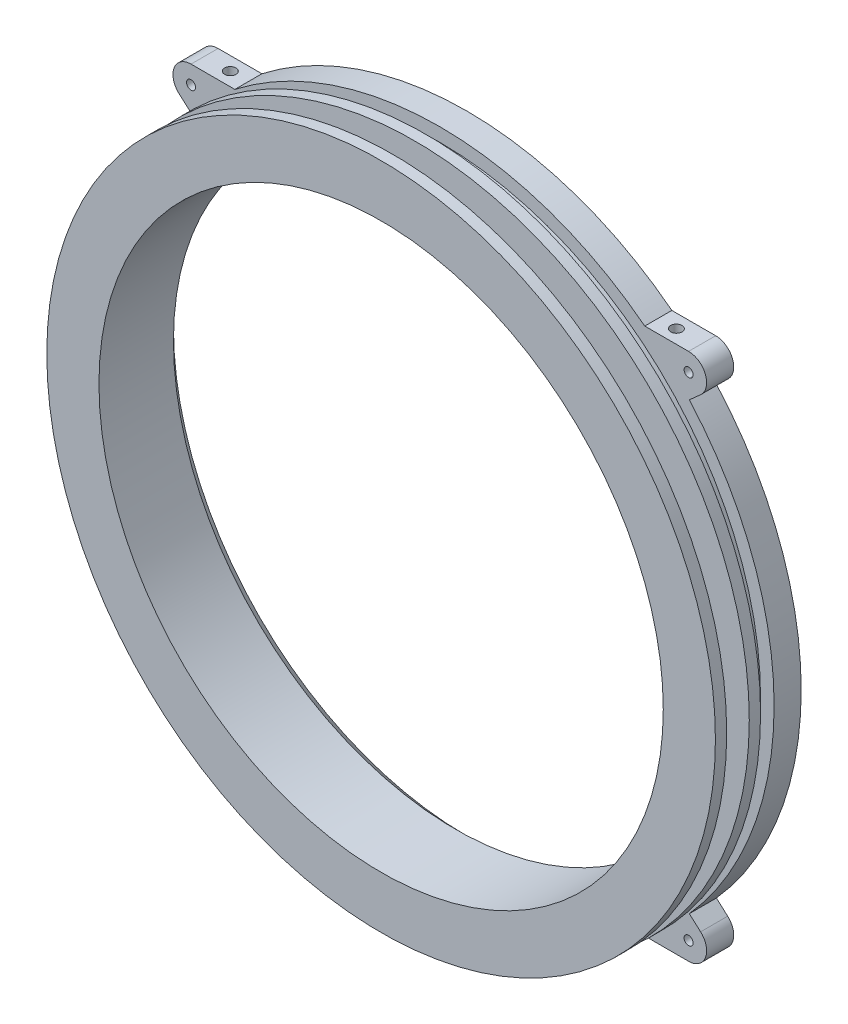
ISO-10303-21;
HEADER;
FILE_DESCRIPTION(('STEP AP214'),'2;1');
FILE_NAME('part.step','',(''),(''),'','','');
FILE_SCHEMA(('AUTOMOTIVE_DESIGN { 1 0 10303 214 1 1 1 1 }'));
ENDSEC;
DATA;
#1=APPLICATION_CONTEXT('core data for automotive mechanical design processes');
#2=APPLICATION_PROTOCOL_DEFINITION('international standard','automotive_design',2000,#1);
#3=PRODUCT_CONTEXT('',#1,'mechanical');
#4=PRODUCT('Part','Part','',(#3));
#5=PRODUCT_RELATED_PRODUCT_CATEGORY('part','',(#4));
#6=PRODUCT_DEFINITION_FORMATION('','',#4);
#7=PRODUCT_DEFINITION_CONTEXT('part definition',#1,'design');
#8=PRODUCT_DEFINITION('design','',#6,#7);
#9=PRODUCT_DEFINITION_SHAPE('','',#8);
#10=(LENGTH_UNIT() NAMED_UNIT(*) SI_UNIT(.MILLI.,.METRE.));
#11=(NAMED_UNIT(*) PLANE_ANGLE_UNIT() SI_UNIT($,.RADIAN.));
#12=(NAMED_UNIT(*) SI_UNIT($,.STERADIAN.) SOLID_ANGLE_UNIT());
#13=UNCERTAINTY_MEASURE_WITH_UNIT(LENGTH_MEASURE(1.E-05),#10,'distance_accuracy_value','');
#14=(GEOMETRIC_REPRESENTATION_CONTEXT(3) GLOBAL_UNCERTAINTY_ASSIGNED_CONTEXT((#13)) GLOBAL_UNIT_ASSIGNED_CONTEXT((#10,
#11,#12)) REPRESENTATION_CONTEXT('',''));
#15=CARTESIAN_POINT('',(0.,0.,0.));
#16=DIRECTION('',(0.,0.,1.));
#17=DIRECTION('',(1.,0.,0.));
#18=AXIS2_PLACEMENT_3D('',#15,#16,#17);
#19=CARTESIAN_POINT('',(0.,0.,12.));
#20=DIRECTION('',(0.,0.,-1.));
#21=DIRECTION('',(-1.,0.,0.));
#22=AXIS2_PLACEMENT_3D('',#19,#20,#21);
#23=CYLINDRICAL_SURFACE('',#22,148.1);
#24=DIRECTION('',(0.,0.,-1.));
#25=VECTOR('',#24,1.);
#26=CARTESIAN_POINT('',(-110.532726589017,-98.5704131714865,12.));
#27=LINE('',#26,#25);
#28=CARTESIAN_POINT('',(-110.532726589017,-98.5704131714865,12.));
#29=VERTEX_POINT('',#28);
#30=CARTESIAN_POINT('',(-110.532726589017,-98.5704131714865,0.));
#31=VERTEX_POINT('',#30);
#32=EDGE_CURVE('E63',#29,#31,#27,.T.);
#33=ORIENTED_EDGE('',*,*,#32,.F.);
#34=CARTESIAN_POINT('',(0.,0.,12.));
#35=DIRECTION('',(0.,0.,1.));
#36=DIRECTION('',(1.,0.,0.));
#37=AXIS2_PLACEMENT_3D('',#34,#35,#36);
#38=CIRCLE('',#37,148.1);
#39=CARTESIAN_POINT('',(-110.532726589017,98.5704131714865,12.));
#40=VERTEX_POINT('',#39);
#41=EDGE_CURVE('E161',#40,#29,#38,.T.);
#42=ORIENTED_EDGE('',*,*,#41,.F.);
#43=DIRECTION('',(0.,0.,-1.));
#44=VECTOR('',#43,1.);
#45=CARTESIAN_POINT('',(-110.532726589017,98.5704131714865,12.));
#46=LINE('',#45,#44);
#47=CARTESIAN_POINT('',(-110.532726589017,98.5704131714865,0.));
#48=VERTEX_POINT('',#47);
#49=EDGE_CURVE('E272',#40,#48,#46,.T.);
#50=ORIENTED_EDGE('',*,*,#49,.T.);
#51=CARTESIAN_POINT('',(0.,0.,0.));
#52=DIRECTION('',(0.,0.,1.));
#53=DIRECTION('',(1.,0.,0.));
#54=AXIS2_PLACEMENT_3D('',#51,#52,#53);
#55=CIRCLE('',#54,148.1);
#56=EDGE_CURVE('E318',#48,#31,#55,.T.);
#57=ORIENTED_EDGE('',*,*,#56,.T.);
#58=EDGE_LOOP('',(#33,#42,#50,#57));
#59=FACE_BOUND('',#58,.T.);
#60=ADVANCED_FACE('F40',(#59),#23,.T.);
#61=DIRECTION('',(0.,0.,-1.));
#62=VECTOR('',#61,1.);
#63=CARTESIAN_POINT('',(-90.7998348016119,-117.,12.));
#64=LINE('',#63,#62);
#65=CARTESIAN_POINT('',(-90.7998348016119,-117.,12.));
#66=VERTEX_POINT('',#65);
#67=CARTESIAN_POINT('',(-90.7998348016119,-117.,0.));
#68=VERTEX_POINT('',#67);
#69=EDGE_CURVE('E179',#66,#68,#64,.T.);
#70=ORIENTED_EDGE('',*,*,#69,.T.);
#71=CARTESIAN_POINT('',(90.7998348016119,-117.,0.));
#72=VERTEX_POINT('',#71);
#73=EDGE_CURVE('E319',#68,#72,#55,.T.);
#74=ORIENTED_EDGE('',*,*,#73,.T.);
#75=DIRECTION('',(0.,0.,-1.));
#76=VECTOR('',#75,1.);
#77=CARTESIAN_POINT('',(90.799834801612,-117.,12.));
#78=LINE('',#77,#76);
#79=CARTESIAN_POINT('',(90.7998348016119,-117.,12.));
#80=VERTEX_POINT('',#79);
#81=EDGE_CURVE('E217',#80,#72,#78,.T.);
#82=ORIENTED_EDGE('',*,*,#81,.F.);
#83=EDGE_CURVE('E55',#66,#80,#38,.T.);
#84=ORIENTED_EDGE('',*,*,#83,.F.);
#85=EDGE_LOOP('',(#70,#74,#82,#84));
#86=FACE_BOUND('',#85,.T.);
#87=ADVANCED_FACE('F337',(#86),#23,.T.);
#88=DIRECTION('',(0.,0.,-1.));
#89=VECTOR('',#88,1.);
#90=CARTESIAN_POINT('',(110.532726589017,-98.5704131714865,12.));
#91=LINE('',#90,#89);
#92=CARTESIAN_POINT('',(110.532726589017,-98.5704131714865,12.));
#93=VERTEX_POINT('',#92);
#94=CARTESIAN_POINT('',(110.532726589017,-98.5704131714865,0.));
#95=VERTEX_POINT('',#94);
#96=EDGE_CURVE('E220',#93,#95,#91,.T.);
#97=ORIENTED_EDGE('',*,*,#96,.T.);
#98=CARTESIAN_POINT('',(110.532726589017,98.5704131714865,0.));
#99=VERTEX_POINT('',#98);
#100=EDGE_CURVE('E354',#95,#99,#55,.T.);
#101=ORIENTED_EDGE('',*,*,#100,.T.);
#102=DIRECTION('',(0.,0.,-1.));
#103=VECTOR('',#102,1.);
#104=CARTESIAN_POINT('',(110.532726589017,98.5704131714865,12.));
#105=LINE('',#104,#103);
#106=CARTESIAN_POINT('',(110.532726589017,98.5704131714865,12.));
#107=VERTEX_POINT('',#106);
#108=EDGE_CURVE('E255',#107,#99,#105,.T.);
#109=ORIENTED_EDGE('',*,*,#108,.F.);
#110=EDGE_CURVE('E356',#93,#107,#38,.T.);
#111=ORIENTED_EDGE('',*,*,#110,.F.);
#112=EDGE_LOOP('',(#97,#101,#109,#111));
#113=FACE_BOUND('',#112,.T.);
#114=ADVANCED_FACE('F338',(#113),#23,.T.);
#115=DIRECTION('',(0.,0.,-1.));
#116=VECTOR('',#115,1.);
#117=CARTESIAN_POINT('',(90.7998348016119,117.,12.));
#118=LINE('',#117,#116);
#119=CARTESIAN_POINT('',(90.7998348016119,117.,12.));
#120=VERTEX_POINT('',#119);
#121=CARTESIAN_POINT('',(90.7998348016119,117.,0.));
#122=VERTEX_POINT('',#121);
#123=EDGE_CURVE('E241',#120,#122,#118,.T.);
#124=ORIENTED_EDGE('',*,*,#123,.T.);
#125=CARTESIAN_POINT('',(-90.7998348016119,117.,0.));
#126=VERTEX_POINT('',#125);
#127=EDGE_CURVE('E312',#122,#126,#55,.T.);
#128=ORIENTED_EDGE('',*,*,#127,.T.);
#129=DIRECTION('',(0.,0.,-1.));
#130=VECTOR('',#129,1.);
#131=CARTESIAN_POINT('',(-90.7998348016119,117.,12.));
#132=LINE('',#131,#130);
#133=CARTESIAN_POINT('',(-90.7998348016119,117.,12.));
#134=VERTEX_POINT('',#133);
#135=EDGE_CURVE('E285',#134,#126,#132,.T.);
#136=ORIENTED_EDGE('',*,*,#135,.F.);
#137=EDGE_CURVE('E317',#120,#134,#38,.T.);
#138=ORIENTED_EDGE('',*,*,#137,.F.);
#139=EDGE_LOOP('',(#124,#128,#136,#138));
#140=FACE_BOUND('',#139,.T.);
#141=ADVANCED_FACE('F343',(#140),#23,.T.);
#142=CARTESIAN_POINT('',(0.,0.,23.));
#143=DIRECTION('',(0.,0.,1.));
#144=DIRECTION('',(1.,0.,0.));
#145=AXIS2_PLACEMENT_3D('',#142,#143,#144);
#146=PLANE('',#145);
#147=CARTESIAN_POINT('',(0.,0.,23.));
#148=DIRECTION('',(0.,0.,1.));
#149=DIRECTION('',(1.,0.,0.));
#150=AXIS2_PLACEMENT_3D('',#147,#148,#149);
#151=CIRCLE('',#150,148.1);
#152=CARTESIAN_POINT('',(148.1,0.,23.));
#153=VERTEX_POINT('',#152);
#154=EDGE_CURVE('E304',#153,#153,#151,.T.);
#155=ORIENTED_EDGE('',*,*,#154,.T.);
#156=EDGE_LOOP('',(#155));
#157=FACE_BOUND('',#156,.T.);
#158=CARTESIAN_POINT('',(0.,0.,23.));
#159=DIRECTION('',(0.,0.,1.));
#160=DIRECTION('',(1.,0.,0.));
#161=AXIS2_PLACEMENT_3D('',#158,#159,#160);
#162=CIRCLE('',#161,133.1);
#163=CARTESIAN_POINT('',(133.1,0.,23.));
#164=VERTEX_POINT('',#163);
#165=EDGE_CURVE('E295',#164,#164,#162,.T.);
#166=ORIENTED_EDGE('',*,*,#165,.F.);
#167=EDGE_LOOP('',(#166));
#168=FACE_BOUND('',#167,.T.);
#169=ADVANCED_FACE('F350',(#157,#168),#146,.T.);
#170=CARTESIAN_POINT('',(0.,0.,12.));
#171=DIRECTION('',(0.,0.,1.));
#172=DIRECTION('',(1.,0.,0.));
#173=AXIS2_PLACEMENT_3D('',#170,#171,#172);
#174=PLANE('',#173);
#175=CARTESIAN_POINT('',(0.,0.,12.));
#176=DIRECTION('',(0.,0.,1.));
#177=DIRECTION('',(1.,0.,0.));
#178=AXIS2_PLACEMENT_3D('',#175,#176,#177);
#179=CIRCLE('',#178,142.1);
#180=CARTESIAN_POINT('',(142.1,0.,12.));
#181=VERTEX_POINT('',#180);
#182=EDGE_CURVE('E313',#181,#181,#179,.T.);
#183=ORIENTED_EDGE('',*,*,#182,.F.);
#184=EDGE_LOOP('',(#183));
#185=FACE_BOUND('',#184,.T.);
#186=ORIENTED_EDGE('',*,*,#41,.T.);
#187=DIRECTION('',(-0.746338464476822,-0.6655665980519,0.));
#188=VECTOR('',#187,1.);
#189=CARTESIAN_POINT('',(-115.532726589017,-103.029292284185,12.));
#190=LINE('',#189,#188);
#191=CARTESIAN_POINT('',(-115.532726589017,-103.029292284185,12.));
#192=VERTEX_POINT('',#191);
#193=EDGE_CURVE('E153',#29,#192,#190,.T.);
#194=ORIENTED_EDGE('',*,*,#193,.T.);
#195=CARTESIAN_POINT('',(-110.208193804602,-109.,12.));
#196=DIRECTION('',(0.,0.,1.));
#197=DIRECTION('',(-1.,0.,0.));
#198=AXIS2_PLACEMENT_3D('',#195,#196,#197);
#199=CIRCLE('',#198,7.99999999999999);
#200=CARTESIAN_POINT('',(-110.208193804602,-117.,12.));
#201=VERTEX_POINT('',#200);
#202=EDGE_CURVE('E158',#192,#201,#199,.T.);
#203=ORIENTED_EDGE('',*,*,#202,.T.);
#204=DIRECTION('',(1.,0.,0.));
#205=VECTOR('',#204,1.);
#206=CARTESIAN_POINT('',(-90.7998348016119,-117.,12.));
#207=LINE('',#206,#205);
#208=EDGE_CURVE('E177',#201,#66,#207,.T.);
#209=ORIENTED_EDGE('',*,*,#208,.T.);
#210=ORIENTED_EDGE('',*,*,#83,.T.);
#211=DIRECTION('',(1.,0.,0.));
#212=VECTOR('',#211,1.);
#213=CARTESIAN_POINT('',(90.7998348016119,-117.,12.));
#214=LINE('',#213,#212);
#215=CARTESIAN_POINT('',(110.208193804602,-117.,12.));
#216=VERTEX_POINT('',#215);
#217=EDGE_CURVE('E206',#80,#216,#214,.T.);
#218=ORIENTED_EDGE('',*,*,#217,.T.);
#219=CARTESIAN_POINT('',(110.208193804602,-109.,12.));
#220=DIRECTION('',(0.,0.,1.));
#221=DIRECTION('',(1.,0.,0.));
#222=AXIS2_PLACEMENT_3D('',#219,#220,#221);
#223=CIRCLE('',#222,7.99999999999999);
#224=CARTESIAN_POINT('',(115.532726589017,-103.029292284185,12.));
#225=VERTEX_POINT('',#224);
#226=EDGE_CURVE('E199',#216,#225,#223,.T.);
#227=ORIENTED_EDGE('',*,*,#226,.T.);
#228=DIRECTION('',(-0.746338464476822,0.6655665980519,0.));
#229=VECTOR('',#228,1.);
#230=CARTESIAN_POINT('',(115.532726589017,-103.029292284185,12.));
#231=LINE('',#230,#229);
#232=EDGE_CURVE('E202',#225,#93,#231,.T.);
#233=ORIENTED_EDGE('',*,*,#232,.T.);
#234=ORIENTED_EDGE('',*,*,#110,.T.);
#235=DIRECTION('',(0.746338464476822,0.6655665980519,0.));
#236=VECTOR('',#235,1.);
#237=CARTESIAN_POINT('',(115.532726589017,103.029292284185,12.));
#238=LINE('',#237,#236);
#239=CARTESIAN_POINT('',(115.532726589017,103.029292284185,12.));
#240=VERTEX_POINT('',#239);
#241=EDGE_CURVE('E233',#107,#240,#238,.T.);
#242=ORIENTED_EDGE('',*,*,#241,.T.);
#243=CARTESIAN_POINT('',(110.208193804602,109.,12.));
#244=DIRECTION('',(0.,0.,1.));
#245=DIRECTION('',(-1.,0.,0.));
#246=AXIS2_PLACEMENT_3D('',#243,#244,#245);
#247=CIRCLE('',#246,7.99999999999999);
#248=CARTESIAN_POINT('',(110.208193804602,117.,12.));
#249=VERTEX_POINT('',#248);
#250=EDGE_CURVE('E235',#240,#249,#247,.T.);
#251=ORIENTED_EDGE('',*,*,#250,.T.);
#252=DIRECTION('',(-1.,0.,0.));
#253=VECTOR('',#252,1.);
#254=CARTESIAN_POINT('',(90.7998348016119,117.,12.));
#255=LINE('',#254,#253);
#256=EDGE_CURVE('E238',#249,#120,#255,.T.);
#257=ORIENTED_EDGE('',*,*,#256,.T.);
#258=ORIENTED_EDGE('',*,*,#137,.T.);
#259=DIRECTION('',(-1.,0.,0.));
#260=VECTOR('',#259,1.);
#261=CARTESIAN_POINT('',(-90.7998348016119,117.,12.));
#262=LINE('',#261,#260);
#263=CARTESIAN_POINT('',(-110.208193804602,117.,12.));
#264=VERTEX_POINT('',#263);
#265=EDGE_CURVE('E265',#134,#264,#262,.T.);
#266=ORIENTED_EDGE('',*,*,#265,.T.);
#267=CARTESIAN_POINT('',(-110.208193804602,109.,12.));
#268=DIRECTION('',(0.,0.,1.));
#269=DIRECTION('',(1.,0.,0.));
#270=AXIS2_PLACEMENT_3D('',#267,#268,#269);
#271=CIRCLE('',#270,7.99999999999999);
#272=CARTESIAN_POINT('',(-115.532726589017,103.029292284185,12.));
#273=VERTEX_POINT('',#272);
#274=EDGE_CURVE('E267',#264,#273,#271,.T.);
#275=ORIENTED_EDGE('',*,*,#274,.T.);
#276=DIRECTION('',(0.746338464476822,-0.6655665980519,0.));
#277=VECTOR('',#276,1.);
#278=CARTESIAN_POINT('',(-115.532726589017,103.029292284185,12.));
#279=LINE('',#278,#277);
#280=EDGE_CURVE('E270',#273,#40,#279,.T.);
#281=ORIENTED_EDGE('',*,*,#280,.T.);
#282=EDGE_LOOP('',(#186,#194,#203,#209,#210,#218,#227,#233,#234,#242,#251,#257,#258,#266,#275,#281));
#283=FACE_BOUND('',#282,.T.);
#284=CARTESIAN_POINT('',(-110.208193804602,109.,12.));
#285=DIRECTION('',(0.,0.,1.));
#286=DIRECTION('',(1.,0.,0.));
#287=AXIS2_PLACEMENT_3D('',#284,#285,#286);
#288=CIRCLE('',#287,2.);
#289=CARTESIAN_POINT('',(-108.208193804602,109.,12.));
#290=VERTEX_POINT('',#289);
#291=EDGE_CURVE('E259',#290,#290,#288,.T.);
#292=ORIENTED_EDGE('',*,*,#291,.F.);
#293=EDGE_LOOP('',(#292));
#294=FACE_BOUND('',#293,.T.);
#295=CARTESIAN_POINT('',(110.208193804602,109.,12.));
#296=DIRECTION('',(0.,0.,1.));
#297=DIRECTION('',(-1.,0.,0.));
#298=AXIS2_PLACEMENT_3D('',#295,#296,#297);
#299=CIRCLE('',#298,2.);
#300=CARTESIAN_POINT('',(108.208193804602,109.,12.));
#301=VERTEX_POINT('',#300);
#302=EDGE_CURVE('E227',#301,#301,#299,.T.);
#303=ORIENTED_EDGE('',*,*,#302,.F.);
#304=EDGE_LOOP('',(#303));
#305=FACE_BOUND('',#304,.T.);
#306=CARTESIAN_POINT('',(110.208193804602,-109.,12.));
#307=DIRECTION('',(0.,0.,1.));
#308=DIRECTION('',(1.,0.,0.));
#309=AXIS2_PLACEMENT_3D('',#306,#307,#308);
#310=CIRCLE('',#309,2.);
#311=CARTESIAN_POINT('',(112.208193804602,-109.,12.));
#312=VERTEX_POINT('',#311);
#313=EDGE_CURVE('E193',#312,#312,#310,.T.);
#314=ORIENTED_EDGE('',*,*,#313,.F.);
#315=EDGE_LOOP('',(#314));
#316=FACE_BOUND('',#315,.T.);
#317=CARTESIAN_POINT('',(-110.208193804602,-109.,12.));
#318=DIRECTION('',(0.,0.,1.));
#319=DIRECTION('',(-1.,0.,0.));
#320=AXIS2_PLACEMENT_3D('',#317,#318,#319);
#321=CIRCLE('',#320,2.);
#322=CARTESIAN_POINT('',(-112.208193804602,-109.,12.));
#323=VERTEX_POINT('',#322);
#324=EDGE_CURVE('E185',#323,#323,#321,.T.);
#325=ORIENTED_EDGE('',*,*,#324,.F.);
#326=EDGE_LOOP('',(#325));
#327=FACE_BOUND('',#326,.T.);
#328=ADVANCED_FACE('F155',(#185,#283,#294,#305,#316,#327),#174,.T.);
#329=CARTESIAN_POINT('',(0.,0.,0.));
#330=DIRECTION('',(0.,0.,1.));
#331=DIRECTION('',(1.,0.,0.));
#332=AXIS2_PLACEMENT_3D('',#329,#330,#331);
#333=PLANE('',#332);
#334=CARTESIAN_POINT('',(0.,0.,0.));
#335=DIRECTION('',(0.,0.,1.));
#336=DIRECTION('',(1.,0.,0.));
#337=AXIS2_PLACEMENT_3D('',#334,#335,#336);
#338=CIRCLE('',#337,130.);
#339=CARTESIAN_POINT('',(130.,0.,0.));
#340=VERTEX_POINT('',#339);
#341=EDGE_CURVE('E48',#340,#340,#338,.T.);
#342=ORIENTED_EDGE('',*,*,#341,.T.);
#343=EDGE_LOOP('',(#342));
#344=FACE_BOUND('',#343,.T.);
#345=ORIENTED_EDGE('',*,*,#56,.F.);
#346=DIRECTION('',(0.746338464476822,-0.6655665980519,0.));
#347=VECTOR('',#346,1.);
#348=CARTESIAN_POINT('',(-115.532726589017,103.029292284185,0.));
#349=LINE('',#348,#347);
#350=CARTESIAN_POINT('',(-115.532726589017,103.029292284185,0.));
#351=VERTEX_POINT('',#350);
#352=EDGE_CURVE('E268',#351,#48,#349,.T.);
#353=ORIENTED_EDGE('',*,*,#352,.F.);
#354=CARTESIAN_POINT('',(-110.208193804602,109.,0.));
#355=DIRECTION('',(0.,0.,1.));
#356=DIRECTION('',(1.,0.,0.));
#357=AXIS2_PLACEMENT_3D('',#354,#355,#356);
#358=CIRCLE('',#357,7.99999999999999);
#359=CARTESIAN_POINT('',(-110.208193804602,117.,0.));
#360=VERTEX_POINT('',#359);
#361=EDGE_CURVE('E274',#360,#351,#358,.T.);
#362=ORIENTED_EDGE('',*,*,#361,.F.);
#363=DIRECTION('',(-1.,0.,0.));
#364=VECTOR('',#363,1.);
#365=CARTESIAN_POINT('',(-90.7998348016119,117.,0.));
#366=LINE('',#365,#364);
#367=EDGE_CURVE('E262',#126,#360,#366,.T.);
#368=ORIENTED_EDGE('',*,*,#367,.F.);
#369=ORIENTED_EDGE('',*,*,#127,.F.);
#370=DIRECTION('',(-1.,0.,0.));
#371=VECTOR('',#370,1.);
#372=CARTESIAN_POINT('',(90.7998348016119,117.,0.));
#373=LINE('',#372,#371);
#374=CARTESIAN_POINT('',(110.208193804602,117.,0.));
#375=VERTEX_POINT('',#374);
#376=EDGE_CURVE('E236',#375,#122,#373,.T.);
#377=ORIENTED_EDGE('',*,*,#376,.F.);
#378=CARTESIAN_POINT('',(110.208193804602,109.,0.));
#379=DIRECTION('',(0.,0.,1.));
#380=DIRECTION('',(-1.,0.,0.));
#381=AXIS2_PLACEMENT_3D('',#378,#379,#380);
#382=CIRCLE('',#381,7.99999999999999);
#383=CARTESIAN_POINT('',(115.532726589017,103.029292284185,0.));
#384=VERTEX_POINT('',#383);
#385=EDGE_CURVE('E243',#384,#375,#382,.T.);
#386=ORIENTED_EDGE('',*,*,#385,.F.);
#387=DIRECTION('',(0.746338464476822,0.6655665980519,0.));
#388=VECTOR('',#387,1.);
#389=CARTESIAN_POINT('',(115.532726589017,103.029292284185,0.));
#390=LINE('',#389,#388);
#391=EDGE_CURVE('E230',#99,#384,#390,.T.);
#392=ORIENTED_EDGE('',*,*,#391,.F.);
#393=ORIENTED_EDGE('',*,*,#100,.F.);
#394=DIRECTION('',(-0.746338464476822,0.6655665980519,0.));
#395=VECTOR('',#394,1.);
#396=CARTESIAN_POINT('',(115.532726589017,-103.029292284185,0.));
#397=LINE('',#396,#395);
#398=CARTESIAN_POINT('',(115.532726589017,-103.029292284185,0.));
#399=VERTEX_POINT('',#398);
#400=EDGE_CURVE('E211',#399,#95,#397,.T.);
#401=ORIENTED_EDGE('',*,*,#400,.F.);
#402=CARTESIAN_POINT('',(110.208193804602,-109.,0.));
#403=DIRECTION('',(0.,0.,1.));
#404=DIRECTION('',(1.,0.,0.));
#405=AXIS2_PLACEMENT_3D('',#402,#403,#404);
#406=CIRCLE('',#405,7.99999999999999);
#407=CARTESIAN_POINT('',(110.208193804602,-117.,0.));
#408=VERTEX_POINT('',#407);
#409=EDGE_CURVE('E196',#408,#399,#406,.T.);
#410=ORIENTED_EDGE('',*,*,#409,.F.);
#411=DIRECTION('',(1.,0.,0.));
#412=VECTOR('',#411,1.);
#413=CARTESIAN_POINT('',(90.7998348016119,-117.,0.));
#414=LINE('',#413,#412);
#415=EDGE_CURVE('E203',#72,#408,#414,.T.);
#416=ORIENTED_EDGE('',*,*,#415,.F.);
#417=ORIENTED_EDGE('',*,*,#73,.F.);
#418=DIRECTION('',(1.,0.,0.));
#419=VECTOR('',#418,1.);
#420=CARTESIAN_POINT('',(-90.7998348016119,-117.,0.));
#421=LINE('',#420,#419);
#422=CARTESIAN_POINT('',(-110.208193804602,-117.,0.));
#423=VERTEX_POINT('',#422);
#424=EDGE_CURVE('E163',#423,#68,#421,.T.);
#425=ORIENTED_EDGE('',*,*,#424,.F.);
#426=CARTESIAN_POINT('',(-110.208193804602,-109.,0.));
#427=DIRECTION('',(0.,0.,1.));
#428=DIRECTION('',(-1.,0.,0.));
#429=AXIS2_PLACEMENT_3D('',#426,#427,#428);
#430=CIRCLE('',#429,7.99999999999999);
#431=CARTESIAN_POINT('',(-115.532726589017,-103.029292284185,0.));
#432=VERTEX_POINT('',#431);
#433=EDGE_CURVE('E184',#432,#423,#430,.T.);
#434=ORIENTED_EDGE('',*,*,#433,.F.);
#435=DIRECTION('',(-0.746338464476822,-0.6655665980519,0.));
#436=VECTOR('',#435,1.);
#437=CARTESIAN_POINT('',(-115.532726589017,-103.029292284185,0.));
#438=LINE('',#437,#436);
#439=EDGE_CURVE('E169',#31,#432,#438,.T.);
#440=ORIENTED_EDGE('',*,*,#439,.F.);
#441=EDGE_LOOP('',(#345,#353,#362,#368,#369,#377,#386,#392,#393,#401,#410,#416,#417,#425,#434,#440));
#442=FACE_BOUND('',#441,.T.);
#443=CARTESIAN_POINT('',(-110.208193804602,109.,0.));
#444=DIRECTION('',(0.,0.,1.));
#445=DIRECTION('',(1.,0.,0.));
#446=AXIS2_PLACEMENT_3D('',#443,#444,#445);
#447=CIRCLE('',#446,2.);
#448=CARTESIAN_POINT('',(-108.208193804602,109.,0.));
#449=VERTEX_POINT('',#448);
#450=EDGE_CURVE('E258',#449,#449,#447,.T.);
#451=ORIENTED_EDGE('',*,*,#450,.T.);
#452=EDGE_LOOP('',(#451));
#453=FACE_BOUND('',#452,.T.);
#454=CARTESIAN_POINT('',(110.208193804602,109.,0.));
#455=DIRECTION('',(0.,0.,1.));
#456=DIRECTION('',(-1.,0.,0.));
#457=AXIS2_PLACEMENT_3D('',#454,#455,#456);
#458=CIRCLE('',#457,2.);
#459=CARTESIAN_POINT('',(108.208193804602,109.,0.));
#460=VERTEX_POINT('',#459);
#461=EDGE_CURVE('E226',#460,#460,#458,.T.);
#462=ORIENTED_EDGE('',*,*,#461,.T.);
#463=EDGE_LOOP('',(#462));
#464=FACE_BOUND('',#463,.T.);
#465=CARTESIAN_POINT('',(110.208193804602,-109.,0.));
#466=DIRECTION('',(0.,0.,1.));
#467=DIRECTION('',(1.,0.,0.));
#468=AXIS2_PLACEMENT_3D('',#465,#466,#467);
#469=CIRCLE('',#468,2.);
#470=CARTESIAN_POINT('',(112.208193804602,-109.,0.));
#471=VERTEX_POINT('',#470);
#472=EDGE_CURVE('E192',#471,#471,#469,.T.);
#473=ORIENTED_EDGE('',*,*,#472,.T.);
#474=EDGE_LOOP('',(#473));
#475=FACE_BOUND('',#474,.T.);
#476=CARTESIAN_POINT('',(-110.208193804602,-109.,0.));
#477=DIRECTION('',(0.,0.,1.));
#478=DIRECTION('',(-1.,0.,0.));
#479=AXIS2_PLACEMENT_3D('',#476,#477,#478);
#480=CIRCLE('',#479,2.);
#481=CARTESIAN_POINT('',(-112.208193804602,-109.,0.));
#482=VERTEX_POINT('',#481);
#483=EDGE_CURVE('E807',#482,#482,#480,.T.);
#484=ORIENTED_EDGE('',*,*,#483,.T.);
#485=EDGE_LOOP('',(#484));
#486=FACE_BOUND('',#485,.T.);
#487=ADVANCED_FACE('F323',(#344,#442,#453,#464,#475,#486),#333,.F.);
#488=CARTESIAN_POINT('',(0.,0.,12.));
#489=DIRECTION('',(0.,0.,-1.));
#490=DIRECTION('',(-1.,0.,0.));
#491=AXIS2_PLACEMENT_3D('',#488,#489,#490);
#492=CYLINDRICAL_SURFACE('',#491,125.);
#493=CARTESIAN_POINT('',(0.,0.,5.00000000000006));
#494=DIRECTION('',(0.,0.,1.));
#495=DIRECTION('',(1.,0.,0.));
#496=AXIS2_PLACEMENT_3D('',#493,#494,#495);
#497=CIRCLE('',#496,125.);
#498=CARTESIAN_POINT('',(125.,0.,5.00000000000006));
#499=VERTEX_POINT('',#498);
#500=EDGE_CURVE('E11',#499,#499,#497,.F.);
#501=ORIENTED_EDGE('',*,*,#500,.T.);
#502=EDGE_LOOP('',(#501));
#503=FACE_BOUND('',#502,.T.);
#504=CARTESIAN_POINT('',(0.,0.,38.));
#505=DIRECTION('',(0.,0.,1.));
#506=DIRECTION('',(1.,0.,0.));
#507=AXIS2_PLACEMENT_3D('',#504,#505,#506);
#508=CIRCLE('',#507,125.);
#509=CARTESIAN_POINT('',(125.,0.,38.));
#510=VERTEX_POINT('',#509);
#511=EDGE_CURVE('E288',#510,#510,#508,.T.);
#512=ORIENTED_EDGE('',*,*,#511,.T.);
#513=EDGE_LOOP('',(#512));
#514=FACE_BOUND('',#513,.T.);
#515=ADVANCED_FACE('F455',(#503,#514),#492,.F.);
#516=CARTESIAN_POINT('',(0.,0.,18.));
#517=DIRECTION('',(0.,0.,-1.));
#518=DIRECTION('',(-1.,0.,0.));
#519=AXIS2_PLACEMENT_3D('',#516,#517,#518);
#520=CYLINDRICAL_SURFACE('',#519,142.1);
#521=CARTESIAN_POINT('',(0.,0.,18.));
#522=DIRECTION('',(0.,0.,1.));
#523=DIRECTION('',(1.,0.,0.));
#524=AXIS2_PLACEMENT_3D('',#521,#522,#523);
#525=CIRCLE('',#524,142.1);
#526=CARTESIAN_POINT('',(142.1,0.,18.));
#527=VERTEX_POINT('',#526);
#528=EDGE_CURVE('E307',#527,#527,#525,.T.);
#529=ORIENTED_EDGE('',*,*,#528,.F.);
#530=EDGE_LOOP('',(#529));
#531=FACE_BOUND('',#530,.T.);
#532=ORIENTED_EDGE('',*,*,#182,.T.);
#533=EDGE_LOOP('',(#532));
#534=FACE_BOUND('',#533,.T.);
#535=ADVANCED_FACE('F448',(#531,#534),#520,.T.);
#536=CARTESIAN_POINT('',(0.,0.,18.));
#537=DIRECTION('',(0.,0.,1.));
#538=DIRECTION('',(1.,0.,0.));
#539=AXIS2_PLACEMENT_3D('',#536,#537,#538);
#540=PLANE('',#539);
#541=ORIENTED_EDGE('',*,*,#528,.T.);
#542=EDGE_LOOP('',(#541));
#543=FACE_BOUND('',#542,.T.);
#544=CARTESIAN_POINT('',(0.,0.,18.));
#545=DIRECTION('',(0.,0.,1.));
#546=DIRECTION('',(1.,0.,0.));
#547=AXIS2_PLACEMENT_3D('',#544,#545,#546);
#548=CIRCLE('',#547,148.1);
#549=CARTESIAN_POINT('',(148.1,0.,18.));
#550=VERTEX_POINT('',#549);
#551=EDGE_CURVE('E301',#550,#550,#548,.T.);
#552=ORIENTED_EDGE('',*,*,#551,.F.);
#553=EDGE_LOOP('',(#552));
#554=FACE_BOUND('',#553,.T.);
#555=ADVANCED_FACE('F445',(#543,#554),#540,.F.);
#556=CARTESIAN_POINT('',(0.,0.,23.));
#557=DIRECTION('',(0.,0.,-1.));
#558=DIRECTION('',(-1.,0.,0.));
#559=AXIS2_PLACEMENT_3D('',#556,#557,#558);
#560=CYLINDRICAL_SURFACE('',#559,148.1);
#561=ORIENTED_EDGE('',*,*,#154,.F.);
#562=EDGE_LOOP('',(#561));
#563=FACE_BOUND('',#562,.T.);
#564=ORIENTED_EDGE('',*,*,#551,.T.);
#565=EDGE_LOOP('',(#564));
#566=FACE_BOUND('',#565,.T.);
#567=ADVANCED_FACE('F440',(#563,#566),#560,.T.);
#568=CARTESIAN_POINT('',(0.,0.,33.));
#569=DIRECTION('',(0.,0.,-1.));
#570=DIRECTION('',(-1.,0.,0.));
#571=AXIS2_PLACEMENT_3D('',#568,#569,#570);
#572=CYLINDRICAL_SURFACE('',#571,133.1);
#573=CARTESIAN_POINT('',(0.,0.,33.));
#574=DIRECTION('',(0.,0.,1.));
#575=DIRECTION('',(1.,0.,0.));
#576=AXIS2_PLACEMENT_3D('',#573,#574,#575);
#577=CIRCLE('',#576,133.1);
#578=CARTESIAN_POINT('',(133.1,0.,33.));
#579=VERTEX_POINT('',#578);
#580=EDGE_CURVE('E298',#579,#579,#577,.T.);
#581=ORIENTED_EDGE('',*,*,#580,.F.);
#582=EDGE_LOOP('',(#581));
#583=FACE_BOUND('',#582,.T.);
#584=ORIENTED_EDGE('',*,*,#165,.T.);
#585=EDGE_LOOP('',(#584));
#586=FACE_BOUND('',#585,.T.);
#587=ADVANCED_FACE('F430',(#583,#586),#572,.T.);
#588=CARTESIAN_POINT('',(0.,0.,38.));
#589=DIRECTION('',(0.,0.,1.));
#590=DIRECTION('',(1.,0.,0.));
#591=AXIS2_PLACEMENT_3D('',#588,#589,#590);
#592=PLANE('',#591);
#593=CARTESIAN_POINT('',(0.,0.,38.));
#594=DIRECTION('',(0.,0.,1.));
#595=DIRECTION('',(1.,0.,0.));
#596=AXIS2_PLACEMENT_3D('',#593,#594,#595);
#597=CIRCLE('',#596,148.1);
#598=CARTESIAN_POINT('',(148.1,0.,38.));
#599=VERTEX_POINT('',#598);
#600=EDGE_CURVE('E292',#599,#599,#597,.T.);
#601=ORIENTED_EDGE('',*,*,#600,.T.);
#602=EDGE_LOOP('',(#601));
#603=FACE_BOUND('',#602,.T.);
#604=ORIENTED_EDGE('',*,*,#511,.F.);
#605=EDGE_LOOP('',(#604));
#606=FACE_BOUND('',#605,.T.);
#607=ADVANCED_FACE('F426',(#603,#606),#592,.T.);
#608=CARTESIAN_POINT('',(0.,0.,33.));
#609=DIRECTION('',(0.,0.,1.));
#610=DIRECTION('',(1.,0.,0.));
#611=AXIS2_PLACEMENT_3D('',#608,#609,#610);
#612=PLANE('',#611);
#613=ORIENTED_EDGE('',*,*,#580,.T.);
#614=EDGE_LOOP('',(#613));
#615=FACE_BOUND('',#614,.T.);
#616=CARTESIAN_POINT('',(0.,0.,33.));
#617=DIRECTION('',(0.,0.,1.));
#618=DIRECTION('',(1.,0.,0.));
#619=AXIS2_PLACEMENT_3D('',#616,#617,#618);
#620=CIRCLE('',#619,148.1);
#621=CARTESIAN_POINT('',(148.1,0.,33.));
#622=VERTEX_POINT('',#621);
#623=EDGE_CURVE('E291',#622,#622,#620,.T.);
#624=ORIENTED_EDGE('',*,*,#623,.F.);
#625=EDGE_LOOP('',(#624));
#626=FACE_BOUND('',#625,.T.);
#627=ADVANCED_FACE('F429',(#615,#626),#612,.F.);
#628=CARTESIAN_POINT('',(0.,0.,38.));
#629=DIRECTION('',(0.,0.,-1.));
#630=DIRECTION('',(-1.,0.,0.));
#631=AXIS2_PLACEMENT_3D('',#628,#629,#630);
#632=CYLINDRICAL_SURFACE('',#631,148.1);
#633=ORIENTED_EDGE('',*,*,#600,.F.);
#634=EDGE_LOOP('',(#633));
#635=FACE_BOUND('',#634,.T.);
#636=ORIENTED_EDGE('',*,*,#623,.T.);
#637=EDGE_LOOP('',(#636));
#638=FACE_BOUND('',#637,.T.);
#639=ADVANCED_FACE('F424',(#635,#638),#632,.T.);
#640=CARTESIAN_POINT('',(-90.7998348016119,117.,12.));
#641=DIRECTION('',(0.,-1.,0.));
#642=DIRECTION('',(0.,0.,-1.));
#643=AXIS2_PLACEMENT_3D('',#640,#641,#642);
#644=PLANE('',#643);
#645=CARTESIAN_POINT('',(-98.7998348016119,117.,6.));
#646=DIRECTION('',(0.,1.,0.));
#647=DIRECTION('',(0.,0.,1.));
#648=AXIS2_PLACEMENT_3D('',#645,#646,#647);
#649=CIRCLE('',#648,2.5);
#650=CARTESIAN_POINT('',(-98.7998348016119,117.,8.49999999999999));
#651=VERTEX_POINT('',#650);
#652=EDGE_CURVE('E801',#651,#651,#649,.T.);
#653=ORIENTED_EDGE('',*,*,#652,.F.);
#654=EDGE_LOOP('',(#653));
#655=FACE_BOUND('',#654,.T.);
#656=ORIENTED_EDGE('',*,*,#367,.T.);
#657=DIRECTION('',(0.,0.,-1.));
#658=VECTOR('',#657,1.);
#659=CARTESIAN_POINT('',(-110.208193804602,117.,12.));
#660=LINE('',#659,#658);
#661=EDGE_CURVE('E282',#264,#360,#660,.T.);
#662=ORIENTED_EDGE('',*,*,#661,.F.);
#663=ORIENTED_EDGE('',*,*,#265,.F.);
#664=ORIENTED_EDGE('',*,*,#135,.T.);
#665=EDGE_LOOP('',(#656,#662,#663,#664));
#666=FACE_BOUND('',#665,.T.);
#667=ADVANCED_FACE('F374',(#655,#666),#644,.F.);
#668=CARTESIAN_POINT('',(-110.208193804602,109.,12.));
#669=DIRECTION('',(0.,0.,-1.));
#670=DIRECTION('',(-1.,0.,0.));
#671=AXIS2_PLACEMENT_3D('',#668,#669,#670);
#672=CYLINDRICAL_SURFACE('',#671,7.99999999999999);
#673=ORIENTED_EDGE('',*,*,#361,.T.);
#674=DIRECTION('',(0.,0.,-1.));
#675=VECTOR('',#674,1.);
#676=CARTESIAN_POINT('',(-115.532726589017,103.029292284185,12.));
#677=LINE('',#676,#675);
#678=EDGE_CURVE('E279',#273,#351,#677,.T.);
#679=ORIENTED_EDGE('',*,*,#678,.F.);
#680=ORIENTED_EDGE('',*,*,#274,.F.);
#681=ORIENTED_EDGE('',*,*,#661,.T.);
#682=EDGE_LOOP('',(#673,#679,#680,#681));
#683=FACE_BOUND('',#682,.T.);
#684=ADVANCED_FACE('F417',(#683),#672,.T.);
#685=CARTESIAN_POINT('',(-115.532726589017,103.029292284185,12.));
#686=DIRECTION('',(0.6655665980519,0.746338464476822,0.));
#687=DIRECTION('',(-0.746338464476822,0.6655665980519,0.));
#688=AXIS2_PLACEMENT_3D('',#685,#686,#687);
#689=PLANE('',#688);
#690=ORIENTED_EDGE('',*,*,#352,.T.);
#691=ORIENTED_EDGE('',*,*,#49,.F.);
#692=ORIENTED_EDGE('',*,*,#280,.F.);
#693=ORIENTED_EDGE('',*,*,#678,.T.);
#694=EDGE_LOOP('',(#690,#691,#692,#693));
#695=FACE_BOUND('',#694,.T.);
#696=ADVANCED_FACE('F413',(#695),#689,.F.);
#697=CARTESIAN_POINT('',(-110.208193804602,109.,12.));
#698=DIRECTION('',(0.,0.,-1.));
#699=DIRECTION('',(-1.,0.,0.));
#700=AXIS2_PLACEMENT_3D('',#697,#698,#699);
#701=CYLINDRICAL_SURFACE('',#700,2.);
#702=ORIENTED_EDGE('',*,*,#291,.T.);
#703=EDGE_LOOP('',(#702));
#704=FACE_BOUND('',#703,.T.);
#705=ORIENTED_EDGE('',*,*,#450,.F.);
#706=EDGE_LOOP('',(#705));
#707=FACE_BOUND('',#706,.T.);
#708=ADVANCED_FACE('F409',(#704,#707),#701,.F.);
#709=CARTESIAN_POINT('',(115.532726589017,103.029292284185,12.));
#710=DIRECTION('',(-0.6655665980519,0.746338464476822,0.));
#711=DIRECTION('',(-0.746338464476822,-0.6655665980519,0.));
#712=AXIS2_PLACEMENT_3D('',#709,#710,#711);
#713=PLANE('',#712);
#714=ORIENTED_EDGE('',*,*,#391,.T.);
#715=DIRECTION('',(0.,0.,-1.));
#716=VECTOR('',#715,1.);
#717=CARTESIAN_POINT('',(115.532726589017,103.029292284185,12.));
#718=LINE('',#717,#716);
#719=EDGE_CURVE('E252',#240,#384,#718,.T.);
#720=ORIENTED_EDGE('',*,*,#719,.F.);
#721=ORIENTED_EDGE('',*,*,#241,.F.);
#722=ORIENTED_EDGE('',*,*,#108,.T.);
#723=EDGE_LOOP('',(#714,#720,#721,#722));
#724=FACE_BOUND('',#723,.T.);
#725=ADVANCED_FACE('F405',(#724),#713,.F.);
#726=CARTESIAN_POINT('',(110.208193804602,109.,12.));
#727=DIRECTION('',(0.,0.,-1.));
#728=DIRECTION('',(-1.,0.,0.));
#729=AXIS2_PLACEMENT_3D('',#726,#727,#728);
#730=CYLINDRICAL_SURFACE('',#729,7.99999999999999);
#731=ORIENTED_EDGE('',*,*,#385,.T.);
#732=DIRECTION('',(0.,0.,-1.));
#733=VECTOR('',#732,1.);
#734=CARTESIAN_POINT('',(110.208193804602,117.,12.));
#735=LINE('',#734,#733);
#736=EDGE_CURVE('E249',#249,#375,#735,.T.);
#737=ORIENTED_EDGE('',*,*,#736,.F.);
#738=ORIENTED_EDGE('',*,*,#250,.F.);
#739=ORIENTED_EDGE('',*,*,#719,.T.);
#740=EDGE_LOOP('',(#731,#737,#738,#739));
#741=FACE_BOUND('',#740,.T.);
#742=ADVANCED_FACE('F401',(#741),#730,.T.);
#743=CARTESIAN_POINT('',(90.7998348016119,117.,12.));
#744=DIRECTION('',(0.,-1.,0.));
#745=DIRECTION('',(0.,0.,-1.));
#746=AXIS2_PLACEMENT_3D('',#743,#744,#745);
#747=PLANE('',#746);
#748=CARTESIAN_POINT('',(98.7998348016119,117.,6.));
#749=DIRECTION('',(0.,-1.,0.));
#750=DIRECTION('',(0.,0.,1.));
#751=AXIS2_PLACEMENT_3D('',#748,#749,#750);
#752=CIRCLE('',#751,2.5);
#753=CARTESIAN_POINT('',(98.7998348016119,117.,8.49999999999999));
#754=VERTEX_POINT('',#753);
#755=EDGE_CURVE('E791',#754,#754,#752,.T.);
#756=ORIENTED_EDGE('',*,*,#755,.T.);
#757=EDGE_LOOP('',(#756));
#758=FACE_BOUND('',#757,.T.);
#759=ORIENTED_EDGE('',*,*,#376,.T.);
#760=ORIENTED_EDGE('',*,*,#123,.F.);
#761=ORIENTED_EDGE('',*,*,#256,.F.);
#762=ORIENTED_EDGE('',*,*,#736,.T.);
#763=EDGE_LOOP('',(#759,#760,#761,#762));
#764=FACE_BOUND('',#763,.T.);
#765=ADVANCED_FACE('F394',(#758,#764),#747,.F.);
#766=CARTESIAN_POINT('',(110.208193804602,109.,12.));
#767=DIRECTION('',(0.,0.,-1.));
#768=DIRECTION('',(-1.,0.,0.));
#769=AXIS2_PLACEMENT_3D('',#766,#767,#768);
#770=CYLINDRICAL_SURFACE('',#769,2.);
#771=ORIENTED_EDGE('',*,*,#302,.T.);
#772=EDGE_LOOP('',(#771));
#773=FACE_BOUND('',#772,.T.);
#774=ORIENTED_EDGE('',*,*,#461,.F.);
#775=EDGE_LOOP('',(#774));
#776=FACE_BOUND('',#775,.T.);
#777=ADVANCED_FACE('F387',(#773,#776),#770,.F.);
#778=CARTESIAN_POINT('',(110.208193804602,-109.,12.));
#779=DIRECTION('',(0.,0.,-1.));
#780=DIRECTION('',(-1.,0.,0.));
#781=AXIS2_PLACEMENT_3D('',#778,#779,#780);
#782=CYLINDRICAL_SURFACE('',#781,7.99999999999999);
#783=ORIENTED_EDGE('',*,*,#409,.T.);
#784=DIRECTION('',(0.,0.,-1.));
#785=VECTOR('',#784,1.);
#786=CARTESIAN_POINT('',(115.532726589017,-103.029292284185,12.));
#787=LINE('',#786,#785);
#788=EDGE_CURVE('E223',#225,#399,#787,.T.);
#789=ORIENTED_EDGE('',*,*,#788,.F.);
#790=ORIENTED_EDGE('',*,*,#226,.F.);
#791=DIRECTION('',(0.,0.,-1.));
#792=VECTOR('',#791,1.);
#793=CARTESIAN_POINT('',(110.208193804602,-117.,12.));
#794=LINE('',#793,#792);
#795=EDGE_CURVE('E208',#216,#408,#794,.T.);
#796=ORIENTED_EDGE('',*,*,#795,.T.);
#797=EDGE_LOOP('',(#783,#789,#790,#796));
#798=FACE_BOUND('',#797,.T.);
#799=ADVANCED_FACE('F385',(#798),#782,.T.);
#800=CARTESIAN_POINT('',(115.532726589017,-103.029292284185,12.));
#801=DIRECTION('',(-0.6655665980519,-0.746338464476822,0.));
#802=DIRECTION('',(0.746338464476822,-0.6655665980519,0.));
#803=AXIS2_PLACEMENT_3D('',#800,#801,#802);
#804=PLANE('',#803);
#805=ORIENTED_EDGE('',*,*,#400,.T.);
#806=ORIENTED_EDGE('',*,*,#96,.F.);
#807=ORIENTED_EDGE('',*,*,#232,.F.);
#808=ORIENTED_EDGE('',*,*,#788,.T.);
#809=EDGE_LOOP('',(#805,#806,#807,#808));
#810=FACE_BOUND('',#809,.T.);
#811=ADVANCED_FACE('F358',(#810),#804,.F.);
#812=CARTESIAN_POINT('',(90.7998348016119,-117.,12.));
#813=DIRECTION('',(0.,1.,0.));
#814=DIRECTION('',(0.,0.,1.));
#815=AXIS2_PLACEMENT_3D('',#812,#813,#814);
#816=PLANE('',#815);
#817=CARTESIAN_POINT('',(98.7998348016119,-117.,6.));
#818=DIRECTION('',(0.,-1.,0.));
#819=DIRECTION('',(0.,0.,1.));
#820=AXIS2_PLACEMENT_3D('',#817,#818,#819);
#821=CIRCLE('',#820,2.5);
#822=CARTESIAN_POINT('',(98.7998348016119,-117.,8.49999999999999));
#823=VERTEX_POINT('',#822);
#824=EDGE_CURVE('E785',#823,#823,#821,.T.);
#825=ORIENTED_EDGE('',*,*,#824,.F.);
#826=EDGE_LOOP('',(#825));
#827=FACE_BOUND('',#826,.T.);
#828=ORIENTED_EDGE('',*,*,#415,.T.);
#829=ORIENTED_EDGE('',*,*,#795,.F.);
#830=ORIENTED_EDGE('',*,*,#217,.F.);
#831=ORIENTED_EDGE('',*,*,#81,.T.);
#832=EDGE_LOOP('',(#828,#829,#830,#831));
#833=FACE_BOUND('',#832,.T.);
#834=ADVANCED_FACE('F382',(#827,#833),#816,.F.);
#835=CARTESIAN_POINT('',(110.208193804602,-109.,12.));
#836=DIRECTION('',(0.,0.,-1.));
#837=DIRECTION('',(-1.,0.,0.));
#838=AXIS2_PLACEMENT_3D('',#835,#836,#837);
#839=CYLINDRICAL_SURFACE('',#838,2.);
#840=ORIENTED_EDGE('',*,*,#313,.T.);
#841=EDGE_LOOP('',(#840));
#842=FACE_BOUND('',#841,.T.);
#843=ORIENTED_EDGE('',*,*,#472,.F.);
#844=EDGE_LOOP('',(#843));
#845=FACE_BOUND('',#844,.T.);
#846=ADVANCED_FACE('F580',(#842,#845),#839,.F.);
#847=CARTESIAN_POINT('',(-115.532726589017,-103.029292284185,12.));
#848=DIRECTION('',(0.6655665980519,-0.746338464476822,0.));
#849=DIRECTION('',(0.746338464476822,0.6655665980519,0.));
#850=AXIS2_PLACEMENT_3D('',#847,#848,#849);
#851=PLANE('',#850);
#852=ORIENTED_EDGE('',*,*,#439,.T.);
#853=DIRECTION('',(0.,0.,-1.));
#854=VECTOR('',#853,1.);
#855=CARTESIAN_POINT('',(-115.532726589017,-103.029292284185,12.));
#856=LINE('',#855,#854);
#857=EDGE_CURVE('E166',#192,#432,#856,.T.);
#858=ORIENTED_EDGE('',*,*,#857,.F.);
#859=ORIENTED_EDGE('',*,*,#193,.F.);
#860=ORIENTED_EDGE('',*,*,#32,.T.);
#861=EDGE_LOOP('',(#852,#858,#859,#860));
#862=FACE_BOUND('',#861,.T.);
#863=ADVANCED_FACE('F167',(#862),#851,.F.);
#864=CARTESIAN_POINT('',(-110.208193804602,-109.,12.));
#865=DIRECTION('',(0.,0.,-1.));
#866=DIRECTION('',(-1.,0.,0.));
#867=AXIS2_PLACEMENT_3D('',#864,#865,#866);
#868=CYLINDRICAL_SURFACE('',#867,7.99999999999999);
#869=ORIENTED_EDGE('',*,*,#433,.T.);
#870=DIRECTION('',(0.,0.,-1.));
#871=VECTOR('',#870,1.);
#872=CARTESIAN_POINT('',(-110.208193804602,-117.,12.));
#873=LINE('',#872,#871);
#874=EDGE_CURVE('E172',#201,#423,#873,.T.);
#875=ORIENTED_EDGE('',*,*,#874,.F.);
#876=ORIENTED_EDGE('',*,*,#202,.F.);
#877=ORIENTED_EDGE('',*,*,#857,.T.);
#878=EDGE_LOOP('',(#869,#875,#876,#877));
#879=FACE_BOUND('',#878,.T.);
#880=ADVANCED_FACE('F174',(#879),#868,.T.);
#881=CARTESIAN_POINT('',(-90.7998348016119,-117.,12.));
#882=DIRECTION('',(0.,1.,0.));
#883=DIRECTION('',(0.,0.,1.));
#884=AXIS2_PLACEMENT_3D('',#881,#882,#883);
#885=PLANE('',#884);
#886=CARTESIAN_POINT('',(-98.7998348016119,-117.,6.));
#887=DIRECTION('',(0.,1.,0.));
#888=DIRECTION('',(0.,0.,1.));
#889=AXIS2_PLACEMENT_3D('',#886,#887,#888);
#890=CIRCLE('',#889,2.5);
#891=CARTESIAN_POINT('',(-98.7998348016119,-117.,8.49999999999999));
#892=VERTEX_POINT('',#891);
#893=EDGE_CURVE('E794',#892,#892,#890,.T.);
#894=ORIENTED_EDGE('',*,*,#893,.T.);
#895=EDGE_LOOP('',(#894));
#896=FACE_BOUND('',#895,.T.);
#897=ORIENTED_EDGE('',*,*,#424,.T.);
#898=ORIENTED_EDGE('',*,*,#69,.F.);
#899=ORIENTED_EDGE('',*,*,#208,.F.);
#900=ORIENTED_EDGE('',*,*,#874,.T.);
#901=EDGE_LOOP('',(#897,#898,#899,#900));
#902=FACE_BOUND('',#901,.T.);
#903=ADVANCED_FACE('F557',(#896,#902),#885,.F.);
#904=CARTESIAN_POINT('',(-110.208193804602,-109.,12.));
#905=DIRECTION('',(0.,0.,-1.));
#906=DIRECTION('',(-1.,0.,0.));
#907=AXIS2_PLACEMENT_3D('',#904,#905,#906);
#908=CYLINDRICAL_SURFACE('',#907,2.);
#909=ORIENTED_EDGE('',*,*,#324,.T.);
#910=EDGE_LOOP('',(#909));
#911=FACE_BOUND('',#910,.T.);
#912=ORIENTED_EDGE('',*,*,#483,.F.);
#913=EDGE_LOOP('',(#912));
#914=FACE_BOUND('',#913,.T.);
#915=ADVANCED_FACE('F546',(#911,#914),#908,.F.);
#916=CARTESIAN_POINT('',(-98.7998348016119,102.,6.));
#917=DIRECTION('',(0.,1.,0.));
#918=DIRECTION('',(0.,0.,1.));
#919=AXIS2_PLACEMENT_3D('',#916,#917,#918);
#920=CYLINDRICAL_SURFACE('',#919,2.5);
#921=CARTESIAN_POINT('',(-98.7998348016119,102.,6.));
#922=DIRECTION('',(0.,1.,0.));
#923=DIRECTION('',(0.,0.,1.));
#924=AXIS2_PLACEMENT_3D('',#921,#922,#923);
#925=CIRCLE('',#924,2.5);
#926=CARTESIAN_POINT('',(-98.7998348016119,102.,8.49999999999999));
#927=VERTEX_POINT('',#926);
#928=EDGE_CURVE('E804',#927,#927,#925,.T.);
#929=ORIENTED_EDGE('',*,*,#928,.F.);
#930=EDGE_LOOP('',(#929));
#931=FACE_BOUND('',#930,.T.);
#932=ORIENTED_EDGE('',*,*,#652,.T.);
#933=EDGE_LOOP('',(#932));
#934=FACE_BOUND('',#933,.T.);
#935=ADVANCED_FACE('F537',(#931,#934),#920,.F.);
#936=CARTESIAN_POINT('',(-98.7998348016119,102.,6.));
#937=DIRECTION('',(0.,1.,0.));
#938=DIRECTION('',(0.,0.,1.));
#939=AXIS2_PLACEMENT_3D('',#936,#937,#938);
#940=PLANE('',#939);
#941=ORIENTED_EDGE('',*,*,#928,.T.);
#942=EDGE_LOOP('',(#941));
#943=FACE_BOUND('',#942,.T.);
#944=ADVANCED_FACE('F526',(#943),#940,.T.);
#945=CARTESIAN_POINT('',(98.7998348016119,102.,6.));
#946=DIRECTION('',(0.,1.,0.));
#947=DIRECTION('',(0.,0.,1.));
#948=AXIS2_PLACEMENT_3D('',#945,#946,#947);
#949=CYLINDRICAL_SURFACE('',#948,2.5);
#950=CARTESIAN_POINT('',(98.7998348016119,102.,6.));
#951=DIRECTION('',(0.,-1.,0.));
#952=DIRECTION('',(0.,0.,1.));
#953=AXIS2_PLACEMENT_3D('',#950,#951,#952);
#954=CIRCLE('',#953,2.5);
#955=CARTESIAN_POINT('',(98.7998348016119,102.,8.49999999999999));
#956=VERTEX_POINT('',#955);
#957=EDGE_CURVE('E798',#956,#956,#954,.T.);
#958=ORIENTED_EDGE('',*,*,#957,.T.);
#959=EDGE_LOOP('',(#958));
#960=FACE_BOUND('',#959,.T.);
#961=ORIENTED_EDGE('',*,*,#755,.F.);
#962=EDGE_LOOP('',(#961));
#963=FACE_BOUND('',#962,.T.);
#964=ADVANCED_FACE('F516',(#960,#963),#949,.F.);
#965=CARTESIAN_POINT('',(98.7998348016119,102.,6.));
#966=DIRECTION('',(0.,1.,0.));
#967=DIRECTION('',(0.,0.,1.));
#968=AXIS2_PLACEMENT_3D('',#965,#966,#967);
#969=PLANE('',#968);
#970=ORIENTED_EDGE('',*,*,#957,.F.);
#971=EDGE_LOOP('',(#970));
#972=FACE_BOUND('',#971,.T.);
#973=ADVANCED_FACE('F505',(#972),#969,.T.);
#974=CARTESIAN_POINT('',(98.7998348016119,-102.,6.));
#975=DIRECTION('',(0.,-1.,0.));
#976=DIRECTION('',(0.,0.,-1.));
#977=AXIS2_PLACEMENT_3D('',#974,#975,#976);
#978=CYLINDRICAL_SURFACE('',#977,2.5);
#979=CARTESIAN_POINT('',(98.7998348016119,-102.,6.));
#980=DIRECTION('',(0.,-1.,0.));
#981=DIRECTION('',(0.,0.,1.));
#982=AXIS2_PLACEMENT_3D('',#979,#980,#981);
#983=CIRCLE('',#982,2.5);
#984=CARTESIAN_POINT('',(98.7998348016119,-102.,8.49999999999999));
#985=VERTEX_POINT('',#984);
#986=EDGE_CURVE('E787',#985,#985,#983,.T.);
#987=ORIENTED_EDGE('',*,*,#986,.F.);
#988=EDGE_LOOP('',(#987));
#989=FACE_BOUND('',#988,.T.);
#990=ORIENTED_EDGE('',*,*,#824,.T.);
#991=EDGE_LOOP('',(#990));
#992=FACE_BOUND('',#991,.T.);
#993=ADVANCED_FACE('F496',(#989,#992),#978,.F.);
#994=CARTESIAN_POINT('',(98.7998348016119,-102.,6.));
#995=DIRECTION('',(0.,-1.,0.));
#996=DIRECTION('',(0.,0.,1.));
#997=AXIS2_PLACEMENT_3D('',#994,#995,#996);
#998=PLANE('',#997);
#999=ORIENTED_EDGE('',*,*,#986,.T.);
#1000=EDGE_LOOP('',(#999));
#1001=FACE_BOUND('',#1000,.T.);
#1002=ADVANCED_FACE('F486',(#1001),#998,.T.);
#1003=CARTESIAN_POINT('',(-98.7998348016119,-102.,6.));
#1004=DIRECTION('',(0.,-1.,0.));
#1005=DIRECTION('',(0.,0.,-1.));
#1006=AXIS2_PLACEMENT_3D('',#1003,#1004,#1005);
#1007=CYLINDRICAL_SURFACE('',#1006,2.5);
#1008=CARTESIAN_POINT('',(-98.7998348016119,-102.,6.));
#1009=DIRECTION('',(0.,1.,0.));
#1010=DIRECTION('',(0.,0.,1.));
#1011=AXIS2_PLACEMENT_3D('',#1008,#1009,#1010);
#1012=CIRCLE('',#1011,2.5);
#1013=CARTESIAN_POINT('',(-98.7998348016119,-102.,8.49999999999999));
#1014=VERTEX_POINT('',#1013);
#1015=EDGE_CURVE('E788',#1014,#1014,#1012,.T.);
#1016=ORIENTED_EDGE('',*,*,#1015,.T.);
#1017=EDGE_LOOP('',(#1016));
#1018=FACE_BOUND('',#1017,.T.);
#1019=ORIENTED_EDGE('',*,*,#893,.F.);
#1020=EDGE_LOOP('',(#1019));
#1021=FACE_BOUND('',#1020,.T.);
#1022=ADVANCED_FACE('F332',(#1018,#1021),#1007,.F.);
#1023=CARTESIAN_POINT('',(-98.7998348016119,-102.,6.));
#1024=DIRECTION('',(0.,-1.,0.));
#1025=DIRECTION('',(0.,0.,1.));
#1026=AXIS2_PLACEMENT_3D('',#1023,#1024,#1025);
#1027=PLANE('',#1026);
#1028=ORIENTED_EDGE('',*,*,#1015,.F.);
#1029=EDGE_LOOP('',(#1028));
#1030=FACE_BOUND('',#1029,.T.);
#1031=ADVANCED_FACE('F327',(#1030),#1027,.T.);
#1032=CARTESIAN_POINT('',(0.,0.,0.));
#1033=DIRECTION('',(0.,0.,-1.));
#1034=DIRECTION('',(-1.,0.,0.));
#1035=AXIS2_PLACEMENT_3D('',#1032,#1033,#1034);
#1036=CONICAL_SURFACE('',#1035,130.,0.785398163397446);
#1037=ORIENTED_EDGE('',*,*,#500,.F.);
#1038=EDGE_LOOP('',(#1037));
#1039=FACE_BOUND('',#1038,.T.);
#1040=ORIENTED_EDGE('',*,*,#341,.F.);
#1041=EDGE_LOOP('',(#1040));
#1042=FACE_BOUND('',#1041,.T.);
#1043=ADVANCED_FACE('F42',(#1039,#1042),#1036,.F.);
#1044=CLOSED_SHELL('',(#60,#87,#114,#141,#169,#328,#487,#515,#535,#555,#567,#587,#607,#627,#639,
#667,#684,#696,#708,#725,#742,#765,#777,#799,#811,#834,#846,#863,#880,#903,#915,#935,#944,#964,
#973,#993,#1002,#1022,#1031,#1043));
#1045=MANIFOLD_SOLID_BREP('B2',#1044);
#1046=ADVANCED_BREP_SHAPE_REPRESENTATION('',(#18,#1045),#14);
#1047=SHAPE_DEFINITION_REPRESENTATION(#9,#1046);
ENDSEC;
END-ISO-10303-21;
